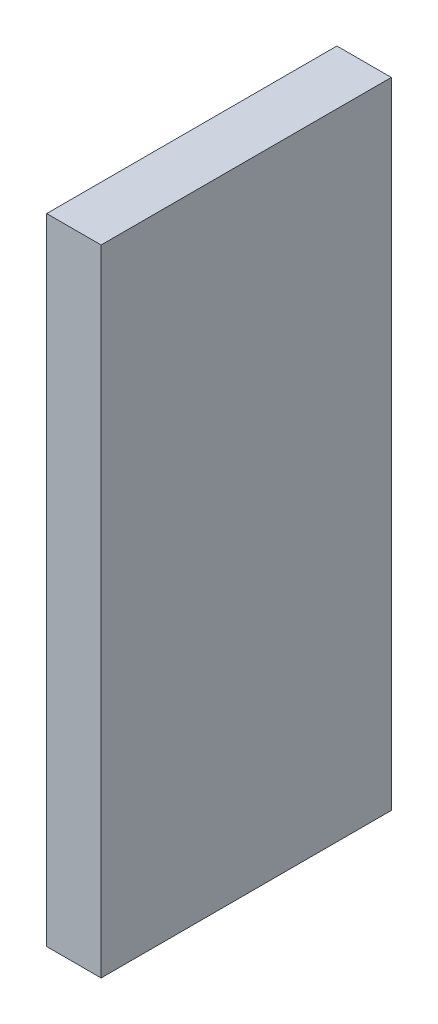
from build123d import *

# Parameters (mm, degrees)
SKETCH_1_W                          = 3
SKETCH_1_H                          = 35
COMPLIANT_CONTACT_PAD_35X16X3_DEPTH = 8


with BuildPart() as part:
    # Sketch 1 → Compliant_Contact_Pad_35x16x3 (new, symmetric)
    with BuildSketch(Plane.XY):
        with Locations((-22.5, 89.5)):
            Rectangle(SKETCH_1_W, SKETCH_1_H)
    extrude(amount=COMPLIANT_CONTACT_PAD_35X16X3_DEPTH, both=True)


solid = part.part
